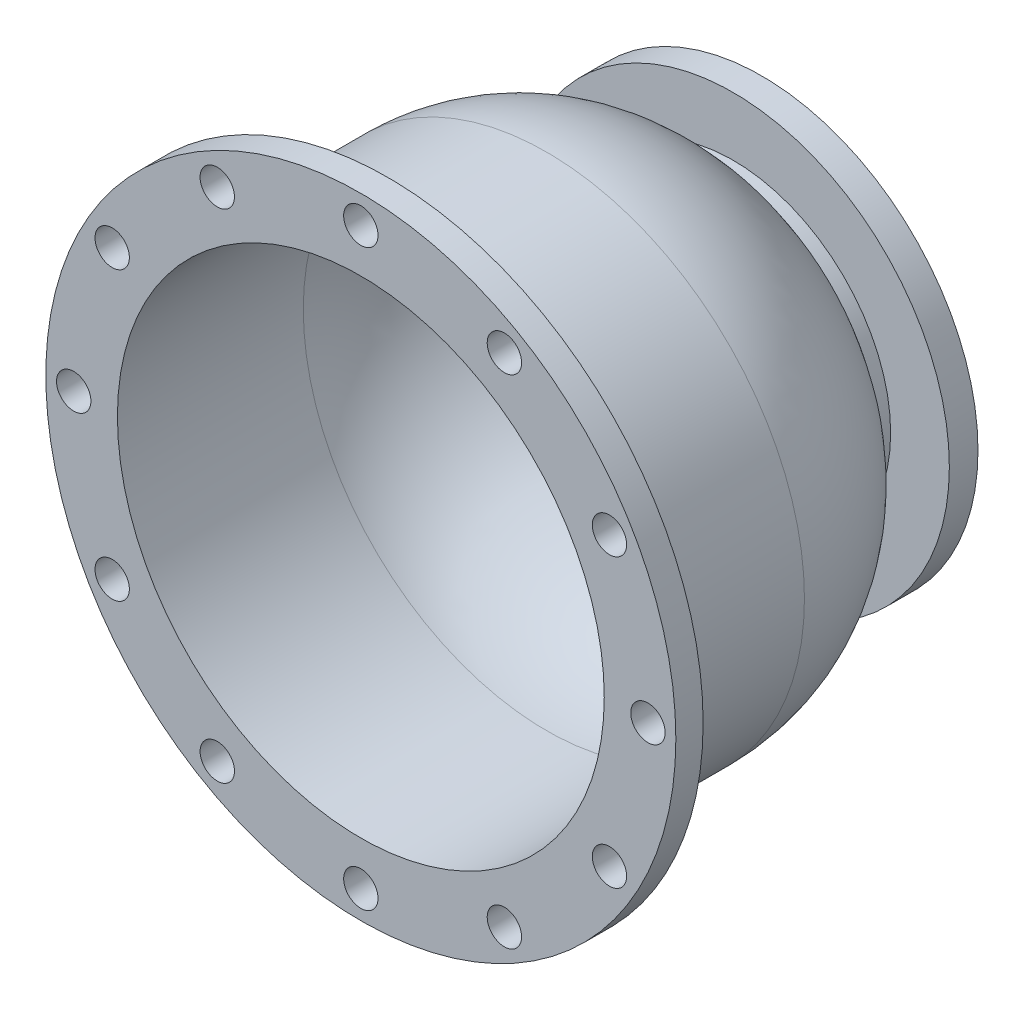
from build123d import *

# Parameters (mm, degrees)
TALADRO_DE_MARGEN_PARA_M201_D = 24
MATRIZC1_COUNT                = 12


with BuildPart() as part:
    # Croquis1 → Revoluci_n1 (revolve)
    with BuildSketch(Plane(origin=(0, 0, 0), x_dir=(0, 0, -1), z_dir=(1, 0, 0)), mode=Mode.PRIVATE) as revoluci_n1_sk:
        with BuildLine():
            Line((0, 220), (0, 170))
            Line((0, 170), (129.8, 170))
            ThreePointArc((129.8, 170), (214.652813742, 134.852813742), (249.8, 50))
            Line((249.8, 50), (304, 50))
            Line((304, 50), (304, 110))
            Line((304, 110), (280, 110))
            Line((280, 110), (280, 151))
            Line((280, 151), (260, 151))
            Line((260, 151), (260, 110))
            Line((260, 110), (249.8, 110))
            ThreePointArc((249.8, 110), (199.262219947, 161.220948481), (129.8, 180))
            Line((129.8, 180), (19.05, 180))
            Line((19.05, 180), (19.05, 220))
            Line((19.05, 220), (0, 220))
        make_face()
    revolve(revoluci_n1_sk.sketch.rotate(Axis((0, 0, 0), (0, 0, -1)), 90), axis=Axis((0, 0, 0), (0, 0, -1)))

    # Taladro de margen para M201 (through all)
    with Locations(Plane(origin=(0, 0, -19.05), x_dir=(-1, 0, 0), z_dir=(0, 0, -1))):
        with Locations((0, -200.5)):
            taladro_de_margen_para_m201 = Hole(TALADRO_DE_MARGEN_PARA_M201_D / 2)

    # MatrizC1: Taladro de margen para M201 ×12 about axis
    matrizc1_axis = Axis((0, 0, 0), (0, 0, 1))
    for i in range(1, MATRIZC1_COUNT):
        add(taladro_de_margen_para_m201.rotate(matrizc1_axis, i * 360 / MATRIZC1_COUNT), mode=Mode.SUBTRACT)


solid = part.part
